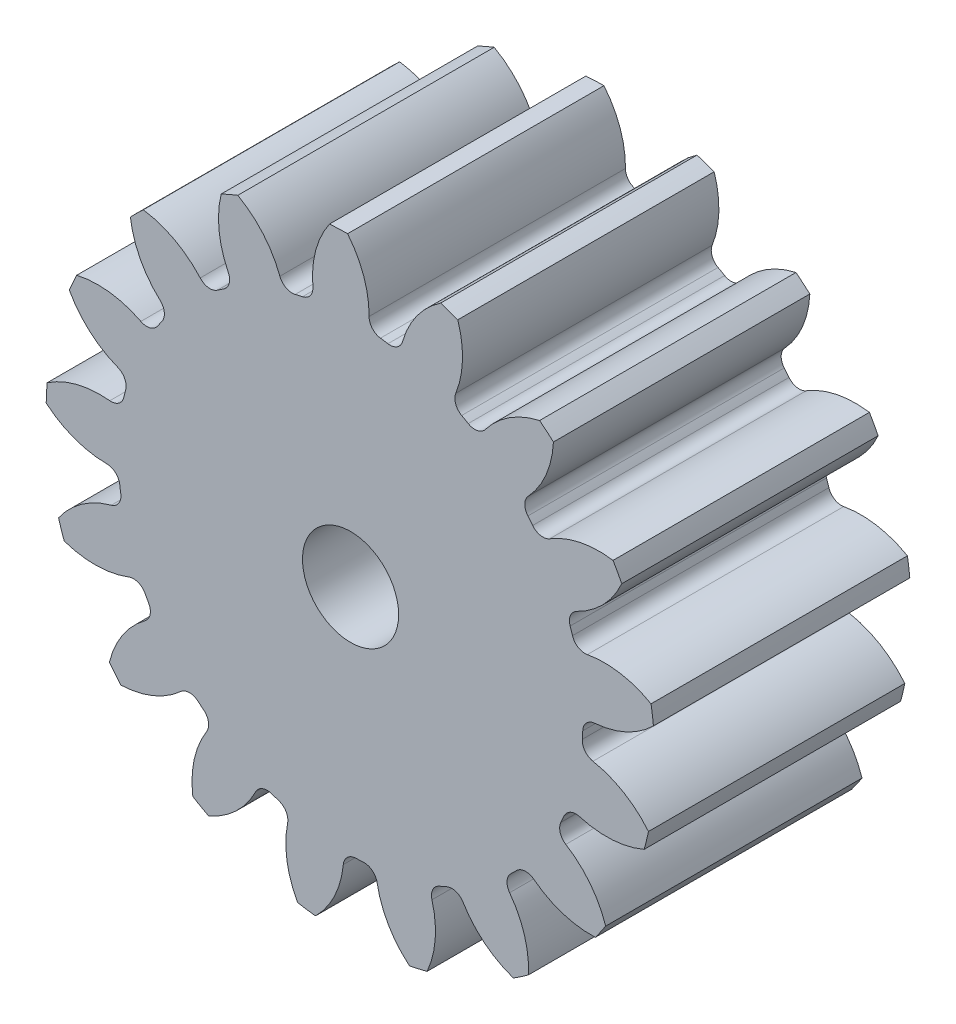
from build123d import *

# Parameters (mm, degrees)
SKETCH3_R         = 120.65
GEARBODY_DEPTH    = 101.6
TOOTHCUT_DEPTH    = 199.583496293
CIRPATTERN1_COUNT = 17
BOREDIA_R         = 19.05
BORE_DEPTH        = 12700


with BuildPart() as part:
    # Sketch3 → gearBody (new body)
    with BuildSketch(Plane.XY):
        Circle(SKETCH3_R)
    extrude(amount=GEARBODY_DEPTH)

    # Sketch2 → toothCut (cut, through all)
    with BuildSketch(Plane.XY):
        with BuildLine():
            ThreePointArc((91.855091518, -6.359857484), (91.946425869, -4.864195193), (92.013408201, -3.367244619))
            ThreePointArc((92.013408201, -3.367244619), (93.442747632, 0.01570817), (96.75812399, 1.595474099))
            ThreePointArc((96.75812399, 1.595474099), (109.742343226, 5.08384795), (120.65, 12.943983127))
            ThreePointArc((120.65, 12.943983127), (121.172920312, -6.410349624), (118.610848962, -25.601478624))
            ThreePointArc((118.610848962, -25.601478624), (108.593396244, -16.634352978), (96.049708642, -11.795489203))
            ThreePointArc((96.049708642, -11.795489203), (92.919518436, -9.874736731), (91.855091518, -6.359857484))
        make_face()
    toothcut = extrude(amount=TOOTHCUT_DEPTH, mode=Mode.SUBTRACT)

    # CirPattern1: toothCut ×17 about axis
    cirpattern1_axis = Axis((0, 0, 0), (0, 0, 1))
    for i in range(1, CIRPATTERN1_COUNT):
        add(toothcut.rotate(cirpattern1_axis, i * 360 / CIRPATTERN1_COUNT), mode=Mode.SUBTRACT)

    # boreDia → bore (cut, symmetric)
    with BuildSketch(Plane.XY):
        Circle(BOREDIA_R)
    extrude(amount=BORE_DEPTH, both=True, mode=Mode.SUBTRACT)


solid = part.part
